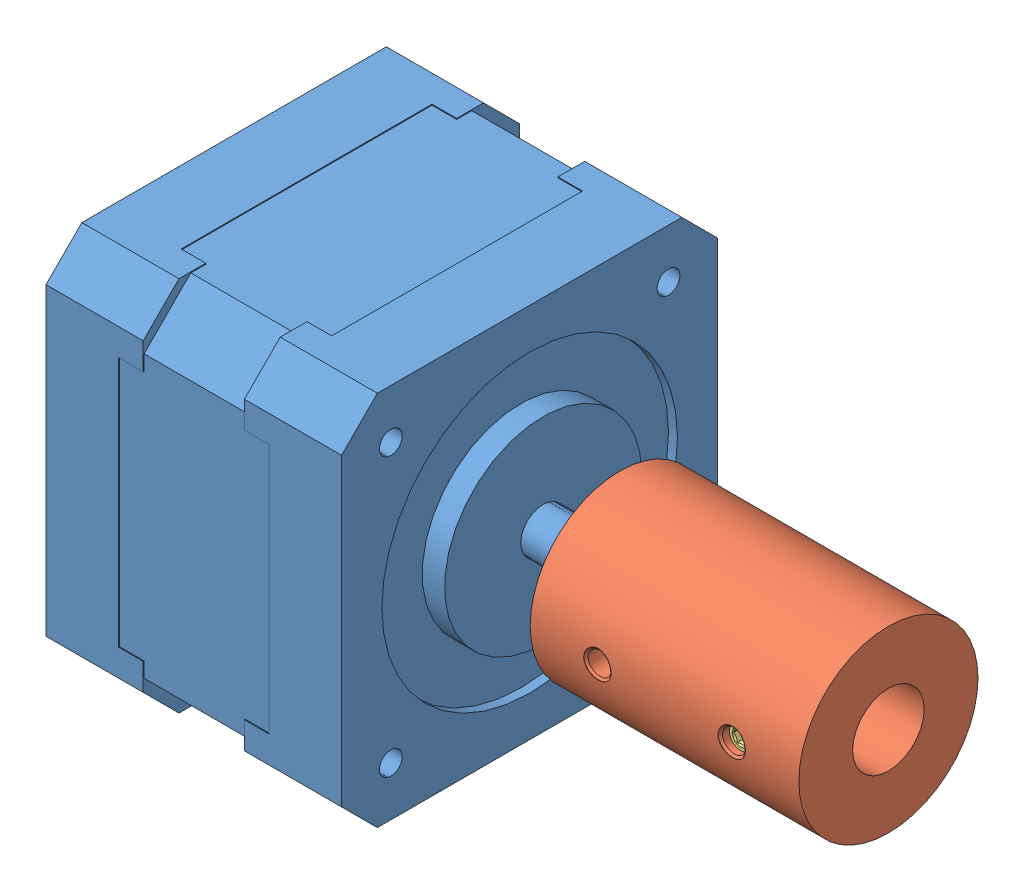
SolidWorks assembly UM_2110_ASM.sldasm, configuration Default (file format 5000). Lengths in mm.
Overall size (73.06 42 42).
6 component instances, 3 part files, 0 mates.
Components (placement in the parent):
- SY42STH33-1: SY42STH33.sldprt [Default] at origin size (56.5 42 42)
- UM_2111-1: UM_2111.sldprt [Default] at (41.5566 0 0) x (-1 0 0) z (0 0 1) size (30 20 20)
- DIN916_M3X5-1: DIN916_M3X5.sldprt [Default] at (34.0566 0 5) x (0 0 -1) z (0 1 0) size (5.04 3 3)
- DIN916_M3X5-2: DIN916_M3X5.sldprt [Default] at (34.0566 -5 0) x (0 1 0) z (0 0 1) size (5.04 3 3)
- DIN916_M3X5-3: DIN916_M3X5.sldprt [Default] at (49.0566 0 6.5) x (0 0 -1) z (0 1 0) size (5.04 3 3)
- DIN916_M3X5-4: DIN916_M3X5.sldprt [Default] at (49.0566 -6.5 0) x (0 1 0) z (0 0 1) size (5.04 3 3)
